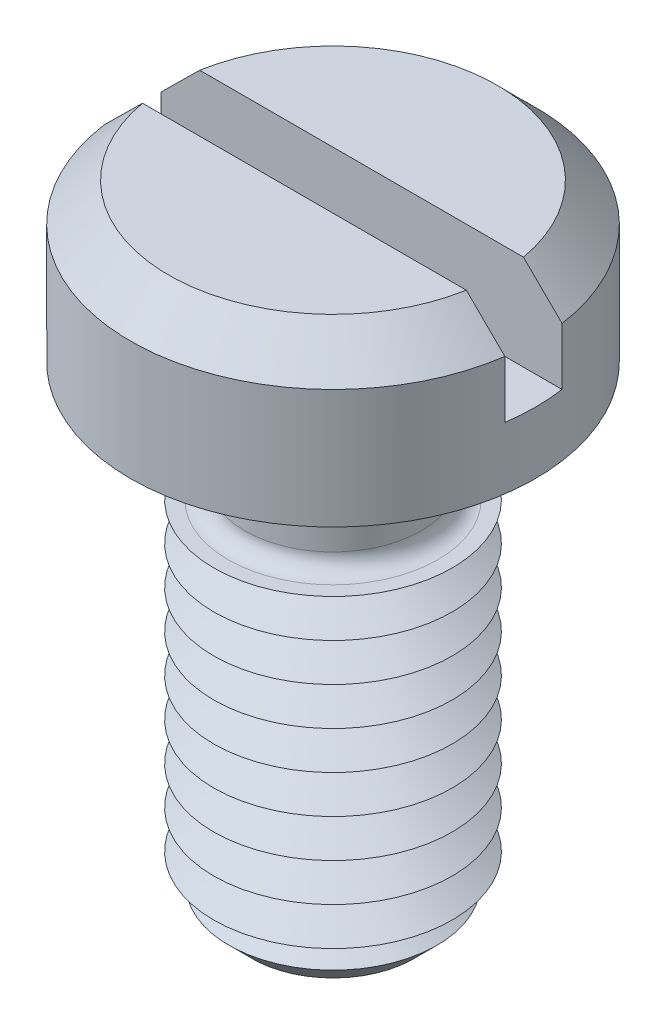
from build123d import *

# Parameters (mm, degrees)
SKETCH1_R           = 4.25
BOSS_EXTRUDE1_DEPTH = 3.3
SKETCH2_R           = 1.85
BOSS_EXTRUDE2_DEPTH = 10
SKETCH3_R           = 2.5
BOSS_EXTRUDE3_DEPTH = 7.5
CHAMFER1_SIZE       = 0.8
LPATTERN1_COUNT     = 9
LPATTERN1_PITCH     = 0.8
FILLET1_R           = 0.35
CHAMFER2_SIZE       = 0.8
SKETCH6_W           = 8.5
SKETCH6_H           = 1.2
CUT_EXTRUDE1_DEPTH  = 2


with BuildPart() as part:
    # Sketch1 → Boss-Extrude1 (new body)
    with BuildSketch(Plane(origin=(0, 0, 0), x_dir=(1, 0, 0), z_dir=(0, 1, 0))):
        with Locations(Location((0, 0, 0), (0, 0, 270))):
            Circle(SKETCH1_R)
    extrude(amount=BOSS_EXTRUDE1_DEPTH)

    # Sketch2 → Boss-Extrude2 (add)
    with BuildSketch(Plane.XZ):
        with Locations(Location((0, 0, 0), (0, 0, 270))):
            Circle(SKETCH2_R)
    extrude(amount=BOSS_EXTRUDE2_DEPTH)

    # Sketch3 → Boss-Extrude3 (add)
    with BuildSketch(Plane.XZ.offset(10)):
        with Locations(Location((0, 0, 0), (0, 0, 270))):
            Circle(SKETCH3_R)
    extrude(amount=-BOSS_EXTRUDE3_DEPTH)

    # Chamfer1
    chamfer1_edges = [part.edges().sort_by_distance(p)[0] for p in [
        (0, -10, 2.5),
    ]]
    chamfer(chamfer1_edges, length=CHAMFER1_SIZE)

    # Sketch5 → Cut-Revolve1 (revolve, cut)
    with BuildSketch(Plane(origin=(0, 0, 0), x_dir=(0, 0, -1), z_dir=(1, 0, 0))):
        Polygon((-2.5, -2.5), (-1.807179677, -2.9), (-2.5, -3.3), align=None)
    cut_revolve1 = revolve(axis=Axis((0, -6.58711856, 0), (0, -1, 0)), mode=Mode.SUBTRACT)

    # LPattern1: Cut-Revolve1 ×9
    with Locations(*[(0, -i * LPATTERN1_PITCH, 0) for i in range(1, LPATTERN1_COUNT)]):
        add(cut_revolve1, mode=Mode.SUBTRACT)

    # Fillet1
    fillet1_edges = [part.edges().sort_by_distance(p)[0] for p in [
        (0, 0, 1.85),
        (0, -2.5, 1.85),
    ]]
    fillet(fillet1_edges, radius=FILLET1_R)

    # Chamfer2
    chamfer2_edges = [part.edges().sort_by_distance(p)[0] for p in [
        (0, 3.3, -4.25),
    ]]
    chamfer(chamfer2_edges, length=CHAMFER2_SIZE)

    # Sketch6 → Cut-Extrude1 (cut)
    with BuildSketch(Plane(origin=(0, 3.3, 0), x_dir=(1, 0, 0), z_dir=(0, 1, 0))):
        Rectangle(SKETCH6_W, SKETCH6_H)
    extrude(amount=-CUT_EXTRUDE1_DEPTH, mode=Mode.SUBTRACT)


solid = part.part
